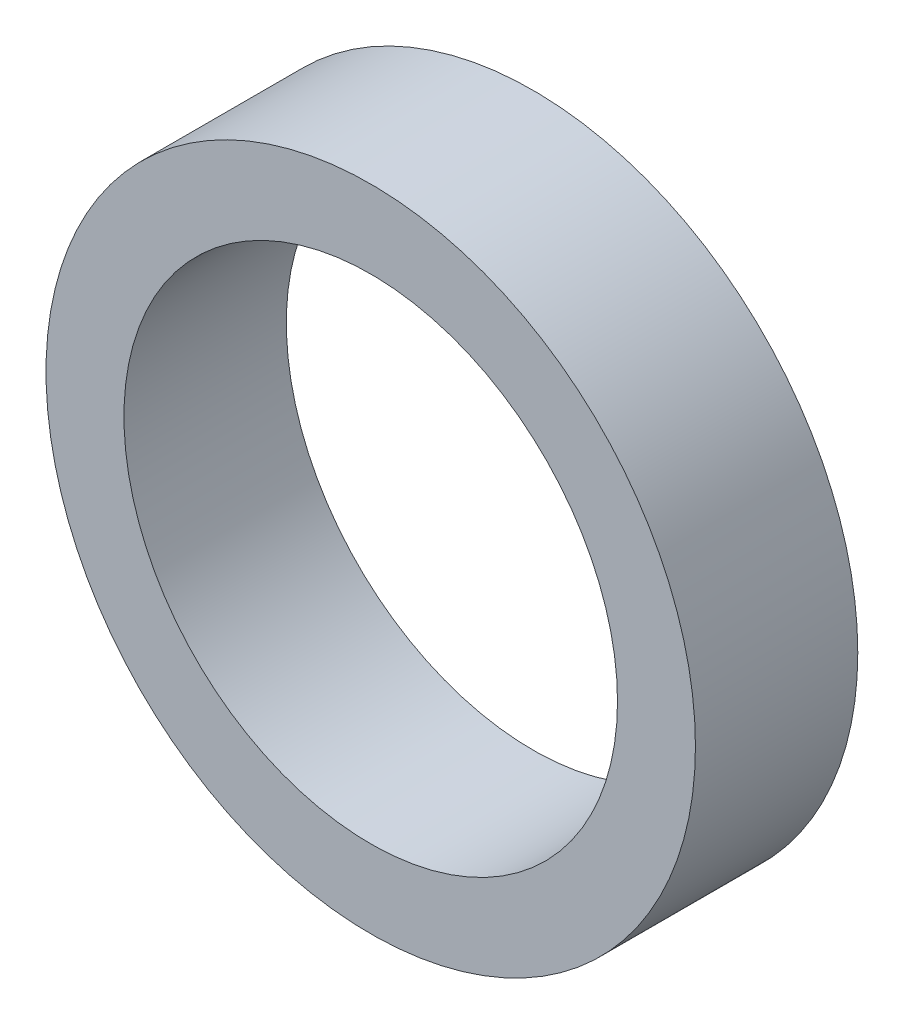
from build123d import *

# Parameters (mm, degrees)
ESQUISSE1_R      = 10
ESQUISSE1_R_2    = 7.6
EXTRUSION1_DEPTH = 5


with BuildPart() as part:
    # Esquisse1 → Extrusion1 (new body)
    with BuildSketch(Plane.XY):
        Circle(ESQUISSE1_R)
        Circle(ESQUISSE1_R_2, mode=Mode.SUBTRACT)
    extrude(amount=EXTRUSION1_DEPTH)


solid = part.part
